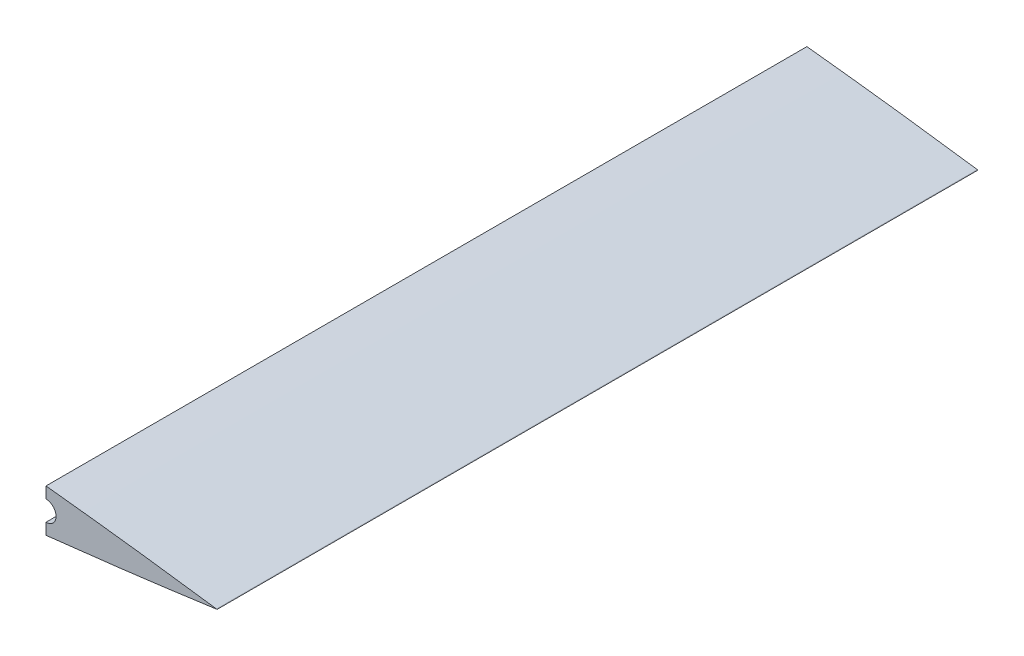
ISO-10303-21;
HEADER;
FILE_DESCRIPTION(('STEP AP214'),'2;1');
FILE_NAME('part.step','',(''),(''),'','','');
FILE_SCHEMA(('AUTOMOTIVE_DESIGN { 1 0 10303 214 1 1 1 1 }'));
ENDSEC;
DATA;
#1=APPLICATION_CONTEXT('core data for automotive mechanical design processes');
#2=APPLICATION_PROTOCOL_DEFINITION('international standard','automotive_design',2000,#1);
#3=PRODUCT_CONTEXT('',#1,'mechanical');
#4=PRODUCT('Part','Part','',(#3));
#5=PRODUCT_RELATED_PRODUCT_CATEGORY('part','',(#4));
#6=PRODUCT_DEFINITION_FORMATION('','',#4);
#7=PRODUCT_DEFINITION_CONTEXT('part definition',#1,'design');
#8=PRODUCT_DEFINITION('design','',#6,#7);
#9=PRODUCT_DEFINITION_SHAPE('','',#8);
#10=(LENGTH_UNIT() NAMED_UNIT(*) SI_UNIT(.MILLI.,.METRE.));
#11=(NAMED_UNIT(*) PLANE_ANGLE_UNIT() SI_UNIT($,.RADIAN.));
#12=(NAMED_UNIT(*) SI_UNIT($,.STERADIAN.) SOLID_ANGLE_UNIT());
#13=UNCERTAINTY_MEASURE_WITH_UNIT(LENGTH_MEASURE(1.E-05),#10,'distance_accuracy_value','');
#14=(GEOMETRIC_REPRESENTATION_CONTEXT(3) GLOBAL_UNCERTAINTY_ASSIGNED_CONTEXT((#13)) GLOBAL_UNIT_ASSIGNED_CONTEXT((#10,
#11,#12)) REPRESENTATION_CONTEXT('',''));
#15=CARTESIAN_POINT('',(0.,0.,0.));
#16=DIRECTION('',(0.,0.,1.));
#17=DIRECTION('',(1.,0.,0.));
#18=AXIS2_PLACEMENT_3D('',#15,#16,#17);
#19=CARTESIAN_POINT('',(50.8625522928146,-1.03281098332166,-227.25));
#20=DIRECTION('',(0.,0.,1.));
#21=DIRECTION('',(-1.,0.,0.));
#22=AXIS2_PLACEMENT_3D('',#19,#20,#21);
#23=CYLINDRICAL_SURFACE('',#22,3.);
#24=CARTESIAN_POINT('',(50.8625522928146,-1.03281098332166,0.));
#25=DIRECTION('',(0.,0.,-1.));
#26=DIRECTION('',(1.,0.,0.));
#27=AXIS2_PLACEMENT_3D('',#24,#25,#26);
#28=CIRCLE('',#27,3.);
#29=CARTESIAN_POINT('',(50.8625522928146,1.96718901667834,0.));
#30=VERTEX_POINT('',#29);
#31=CARTESIAN_POINT('',(50.8625522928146,-4.03281098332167,0.));
#32=VERTEX_POINT('',#31);
#33=EDGE_CURVE('E168',#30,#32,#28,.T.);
#34=ORIENTED_EDGE('',*,*,#33,.F.);
#35=DIRECTION('',(0.,0.,1.));
#36=VECTOR('',#35,1.);
#37=CARTESIAN_POINT('',(50.8625522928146,1.96718901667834,-227.25));
#38=LINE('',#37,#36);
#39=CARTESIAN_POINT('',(50.8625522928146,1.96718901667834,-227.25));
#40=VERTEX_POINT('',#39);
#41=EDGE_CURVE('E196',#40,#30,#38,.T.);
#42=ORIENTED_EDGE('',*,*,#41,.F.);
#43=CARTESIAN_POINT('',(50.8625522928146,-1.03281098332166,-227.25));
#44=DIRECTION('',(0.,0.,-1.));
#45=DIRECTION('',(1.,0.,0.));
#46=AXIS2_PLACEMENT_3D('',#43,#44,#45);
#47=CIRCLE('',#46,3.);
#48=CARTESIAN_POINT('',(50.8625522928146,-4.03281098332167,-227.25));
#49=VERTEX_POINT('',#48);
#50=EDGE_CURVE('E172',#40,#49,#47,.T.);
#51=ORIENTED_EDGE('',*,*,#50,.T.);
#52=DIRECTION('',(0.,0.,1.));
#53=VECTOR('',#52,1.);
#54=CARTESIAN_POINT('',(50.8625522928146,-4.03281098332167,-227.25));
#55=LINE('',#54,#53);
#56=EDGE_CURVE('E11',#49,#32,#55,.T.);
#57=ORIENTED_EDGE('',*,*,#56,.T.);
#58=EDGE_LOOP('',(#34,#42,#51,#57));
#59=FACE_BOUND('',#58,.T.);
#60=ADVANCED_FACE('F45',(#59),#23,.F.);
#61=CARTESIAN_POINT('',(50.8625522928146,-4.03281098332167,-227.25));
#62=DIRECTION('',(1.,0.,0.));
#63=DIRECTION('',(0.,1.,0.));
#64=AXIS2_PLACEMENT_3D('',#61,#62,#63);
#65=PLANE('',#64);
#66=DIRECTION('',(0.,-1.,0.));
#67=VECTOR('',#66,1.);
#68=CARTESIAN_POINT('',(50.8625522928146,-4.03281098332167,0.));
#69=LINE('',#68,#67);
#70=CARTESIAN_POINT('',(50.8625522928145,-7.42389794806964,0.));
#71=VERTEX_POINT('',#70);
#72=EDGE_CURVE('E162',#32,#71,#69,.T.);
#73=ORIENTED_EDGE('',*,*,#72,.F.);
#74=ORIENTED_EDGE('',*,*,#56,.F.);
#75=DIRECTION('',(0.,-1.,0.));
#76=VECTOR('',#75,1.);
#77=CARTESIAN_POINT('',(50.8625522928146,-4.03281098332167,-227.25));
#78=LINE('',#77,#76);
#79=CARTESIAN_POINT('',(50.8625522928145,-7.42389794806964,-227.25));
#80=VERTEX_POINT('',#79);
#81=EDGE_CURVE('E94',#49,#80,#78,.T.);
#82=ORIENTED_EDGE('',*,*,#81,.T.);
#83=DIRECTION('',(0.,0.,1.));
#84=VECTOR('',#83,1.);
#85=CARTESIAN_POINT('',(50.8625522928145,-7.42389794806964,-227.25));
#86=LINE('',#85,#84);
#87=EDGE_CURVE('E54',#80,#71,#86,.T.);
#88=ORIENTED_EDGE('',*,*,#87,.T.);
#89=EDGE_LOOP('',(#73,#74,#82,#88));
#90=FACE_BOUND('',#89,.T.);
#91=ADVANCED_FACE('F152',(#90),#65,.F.);
#92=CARTESIAN_POINT('',(50.8625522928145,-7.42389794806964,-227.25));
#93=CARTESIAN_POINT('',(51.3165188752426,-7.37398101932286,-227.25));
#94=CARTESIAN_POINT('',(55.7358718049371,-6.88640909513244,-227.25));
#95=CARTESIAN_POINT('',(64.1205689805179,-5.931285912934,-227.25));
#96=CARTESIAN_POINT('',(76.0119698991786,-4.48991833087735,-227.25));
#97=CARTESIAN_POINT('',(88.6303788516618,-2.87995882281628,-227.25));
#98=CARTESIAN_POINT('',(97.2752375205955,-1.67880485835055,-227.25));
#99=CARTESIAN_POINT('',(101.962552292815,-1.03281098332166,-227.25));
#100=B_SPLINE_CURVE_WITH_KNOTS('',3,(#92,#93,#94,#95,#96,#97,#98,#99),.UNSPECIFIED.,.F.,.F.,(4,
1,1,1,1,4),(0.89879089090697,0.901603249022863,0.926170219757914,0.950757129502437,
0.975365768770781,1.00450282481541),.UNSPECIFIED.);
#101=DIRECTION('',(0.,0.,1.));
#102=VECTOR('',#101,1.);
#103=SURFACE_OF_LINEAR_EXTRUSION('',#100,#102);
#104=CARTESIAN_POINT('',(50.8625522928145,-7.42389794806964,0.));
#105=CARTESIAN_POINT('',(51.3165188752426,-7.37398101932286,0.));
#106=CARTESIAN_POINT('',(55.7358718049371,-6.88640909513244,0.));
#107=CARTESIAN_POINT('',(64.1205689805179,-5.931285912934,0.));
#108=CARTESIAN_POINT('',(76.0119698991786,-4.48991833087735,0.));
#109=CARTESIAN_POINT('',(88.6303788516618,-2.87995882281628,0.));
#110=CARTESIAN_POINT('',(97.2752375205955,-1.67880485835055,0.));
#111=CARTESIAN_POINT('',(101.962552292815,-1.03281098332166,0.));
#112=B_SPLINE_CURVE_WITH_KNOTS('',3,(#104,#105,#106,#107,#108,#109,#110,#111),.UNSPECIFIED.,.F.,
.F.,(4,1,1,1,1,4),(0.89879089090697,0.901603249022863,0.926170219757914,0.950757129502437,
0.975365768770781,1.00450282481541),.UNSPECIFIED.);
#113=CARTESIAN_POINT('',(101.962552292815,-1.03281098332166,0.));
#114=VERTEX_POINT('',#113);
#115=EDGE_CURVE('E167',#71,#114,#112,.T.);
#116=ORIENTED_EDGE('',*,*,#115,.F.);
#117=ORIENTED_EDGE('',*,*,#87,.F.);
#118=CARTESIAN_POINT('',(101.962552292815,-1.03281098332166,-227.25));
#119=VERTEX_POINT('',#118);
#120=EDGE_CURVE('E125',#80,#119,#100,.T.);
#121=ORIENTED_EDGE('',*,*,#120,.T.);
#122=DIRECTION('',(0.,0.,1.));
#123=VECTOR('',#122,1.);
#124=CARTESIAN_POINT('',(101.962552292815,-1.03281098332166,-227.25));
#125=LINE('',#124,#123);
#126=EDGE_CURVE('E118',#119,#114,#125,.T.);
#127=ORIENTED_EDGE('',*,*,#126,.T.);
#128=EDGE_LOOP('',(#116,#117,#121,#127));
#129=FACE_BOUND('',#128,.T.);
#130=ADVANCED_FACE('F150',(#129),#103,.T.);
#131=CARTESIAN_POINT('',(101.962552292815,-1.03281098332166,-227.25));
#132=DIRECTION('',(-0.136867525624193,-0.990589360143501,0.));
#133=DIRECTION('',(0.990589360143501,-0.136867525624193,0.));
#134=AXIS2_PLACEMENT_3D('',#131,#132,#133);
#135=PLANE('',#134);
#136=DIRECTION('',(-0.990589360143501,0.136867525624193,0.));
#137=VECTOR('',#136,1.);
#138=CARTESIAN_POINT('',(101.962552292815,-1.03281098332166,0.));
#139=LINE('',#138,#137);
#140=CARTESIAN_POINT('',(101.799188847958,-1.01023941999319,0.));
#141=VERTEX_POINT('',#140);
#142=EDGE_CURVE('E181',#114,#141,#139,.T.);
#143=ORIENTED_EDGE('',*,*,#142,.F.);
#144=ORIENTED_EDGE('',*,*,#126,.F.);
#145=DIRECTION('',(-0.990589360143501,0.136867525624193,0.));
#146=VECTOR('',#145,1.);
#147=CARTESIAN_POINT('',(101.962552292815,-1.03281098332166,-227.25));
#148=LINE('',#147,#146);
#149=CARTESIAN_POINT('',(101.799188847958,-1.01023941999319,-227.25));
#150=VERTEX_POINT('',#149);
#151=EDGE_CURVE('E106',#119,#150,#148,.T.);
#152=ORIENTED_EDGE('',*,*,#151,.T.);
#153=DIRECTION('',(0.,0.,1.));
#154=VECTOR('',#153,1.);
#155=CARTESIAN_POINT('',(101.799188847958,-1.01023941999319,-227.25));
#156=LINE('',#155,#154);
#157=EDGE_CURVE('E112',#150,#141,#156,.T.);
#158=ORIENTED_EDGE('',*,*,#157,.T.);
#159=EDGE_LOOP('',(#143,#144,#152,#158));
#160=FACE_BOUND('',#159,.T.);
#161=ADVANCED_FACE('F121',(#160),#135,.F.);
#162=CARTESIAN_POINT('',(101.799188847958,-1.01023941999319,-227.25));
#163=CARTESIAN_POINT('',(97.1662744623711,-0.37213420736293,-227.25));
#164=CARTESIAN_POINT('',(88.5756524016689,0.81992622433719,-227.25));
#165=CARTESIAN_POINT('',(76.0115979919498,2.42157660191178,-227.25));
#166=CARTESIAN_POINT('',(64.120042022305,3.86166442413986,-227.25));
#167=CARTESIAN_POINT('',(55.7354711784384,4.81585917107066,-227.25));
#168=CARTESIAN_POINT('',(51.3162950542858,5.30293103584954,-227.25));
#169=CARTESIAN_POINT('',(50.8625522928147,5.35277410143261,-227.25));
#170=B_SPLINE_CURVE_WITH_KNOTS('',3,(#162,#163,#164,#165,#166,#167,#168,#169),.UNSPECIFIED.,.F.,
.F.,(4,1,1,1,1,4),(-0.00416433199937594,0.0246342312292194,0.0492428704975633,
0.0738297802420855,0.0983967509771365,0.101207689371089),.UNSPECIFIED.);
#171=DIRECTION('',(0.,0.,1.));
#172=VECTOR('',#171,1.);
#173=SURFACE_OF_LINEAR_EXTRUSION('',#170,#172);
#174=CARTESIAN_POINT('',(101.799188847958,-1.01023941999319,0.));
#175=CARTESIAN_POINT('',(97.1662744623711,-0.37213420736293,0.));
#176=CARTESIAN_POINT('',(88.5756524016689,0.81992622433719,0.));
#177=CARTESIAN_POINT('',(76.0115979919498,2.42157660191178,0.));
#178=CARTESIAN_POINT('',(64.120042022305,3.86166442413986,0.));
#179=CARTESIAN_POINT('',(55.7354711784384,4.81585917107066,0.));
#180=CARTESIAN_POINT('',(51.3162950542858,5.30293103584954,0.));
#181=CARTESIAN_POINT('',(50.8625522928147,5.35277410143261,0.));
#182=B_SPLINE_CURVE_WITH_KNOTS('',3,(#174,#175,#176,#177,#178,#179,#180,#181),.UNSPECIFIED.,.F.,
.F.,(4,1,1,1,1,4),(-0.00416433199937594,0.0246342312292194,0.0492428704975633,
0.0738297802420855,0.0983967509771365,0.101207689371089),.UNSPECIFIED.);
#183=CARTESIAN_POINT('',(50.8625522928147,5.35277410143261,0.));
#184=VERTEX_POINT('',#183);
#185=EDGE_CURVE('E114',#141,#184,#182,.T.);
#186=ORIENTED_EDGE('',*,*,#185,.F.);
#187=ORIENTED_EDGE('',*,*,#157,.F.);
#188=CARTESIAN_POINT('',(50.8625522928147,5.35277410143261,-227.25));
#189=VERTEX_POINT('',#188);
#190=EDGE_CURVE('E102',#150,#189,#170,.T.);
#191=ORIENTED_EDGE('',*,*,#190,.T.);
#192=DIRECTION('',(0.,0.,1.));
#193=VECTOR('',#192,1.);
#194=CARTESIAN_POINT('',(50.8625522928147,5.35277410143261,-227.25));
#195=LINE('',#194,#193);
#196=EDGE_CURVE('E119',#189,#184,#195,.T.);
#197=ORIENTED_EDGE('',*,*,#196,.T.);
#198=EDGE_LOOP('',(#186,#187,#191,#197));
#199=FACE_BOUND('',#198,.T.);
#200=ADVANCED_FACE('F113',(#199),#173,.T.);
#201=CARTESIAN_POINT('',(50.8625522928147,5.35277410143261,-227.25));
#202=DIRECTION('',(1.,0.,0.));
#203=DIRECTION('',(0.,1.,0.));
#204=AXIS2_PLACEMENT_3D('',#201,#202,#203);
#205=PLANE('',#204);
#206=DIRECTION('',(0.,-1.,0.));
#207=VECTOR('',#206,1.);
#208=CARTESIAN_POINT('',(50.8625522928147,5.35277410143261,0.));
#209=LINE('',#208,#207);
#210=EDGE_CURVE('E82',#184,#30,#209,.T.);
#211=ORIENTED_EDGE('',*,*,#210,.F.);
#212=ORIENTED_EDGE('',*,*,#196,.F.);
#213=DIRECTION('',(0.,-1.,0.));
#214=VECTOR('',#213,1.);
#215=CARTESIAN_POINT('',(50.8625522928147,5.35277410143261,-227.25));
#216=LINE('',#215,#214);
#217=EDGE_CURVE('E62',#189,#40,#216,.T.);
#218=ORIENTED_EDGE('',*,*,#217,.T.);
#219=ORIENTED_EDGE('',*,*,#41,.T.);
#220=EDGE_LOOP('',(#211,#212,#218,#219));
#221=FACE_BOUND('',#220,.T.);
#222=ADVANCED_FACE('F146',(#221),#205,.F.);
#223=CARTESIAN_POINT('',(50.8625522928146,-1.03281098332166,-227.25));
#224=DIRECTION('',(0.,0.,-1.));
#225=DIRECTION('',(1.,0.,0.));
#226=AXIS2_PLACEMENT_3D('',#223,#224,#225);
#227=PLANE('',#226);
#228=ORIENTED_EDGE('',*,*,#50,.F.);
#229=ORIENTED_EDGE('',*,*,#217,.F.);
#230=ORIENTED_EDGE('',*,*,#190,.F.);
#231=ORIENTED_EDGE('',*,*,#151,.F.);
#232=ORIENTED_EDGE('',*,*,#120,.F.);
#233=ORIENTED_EDGE('',*,*,#81,.F.);
#234=EDGE_LOOP('',(#228,#229,#230,#231,#232,#233));
#235=FACE_BOUND('',#234,.T.);
#236=ADVANCED_FACE('F104',(#235),#227,.T.);
#237=CARTESIAN_POINT('',(50.8625522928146,-1.03281098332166,0.));
#238=DIRECTION('',(0.,0.,-1.));
#239=DIRECTION('',(1.,0.,0.));
#240=AXIS2_PLACEMENT_3D('',#237,#238,#239);
#241=PLANE('',#240);
#242=ORIENTED_EDGE('',*,*,#33,.T.);
#243=ORIENTED_EDGE('',*,*,#72,.T.);
#244=ORIENTED_EDGE('',*,*,#115,.T.);
#245=ORIENTED_EDGE('',*,*,#142,.T.);
#246=ORIENTED_EDGE('',*,*,#185,.T.);
#247=ORIENTED_EDGE('',*,*,#210,.T.);
#248=EDGE_LOOP('',(#242,#243,#244,#245,#246,#247));
#249=FACE_BOUND('',#248,.T.);
#250=ADVANCED_FACE('F173',(#249),#241,.F.);
#251=CLOSED_SHELL('',(#60,#91,#130,#161,#200,#222,#236,#250));
#252=MANIFOLD_SOLID_BREP('B2',#251);
#253=ADVANCED_BREP_SHAPE_REPRESENTATION('',(#18,#252),#14);
#254=SHAPE_DEFINITION_REPRESENTATION(#9,#253);
ENDSEC;
END-ISO-10303-21;
